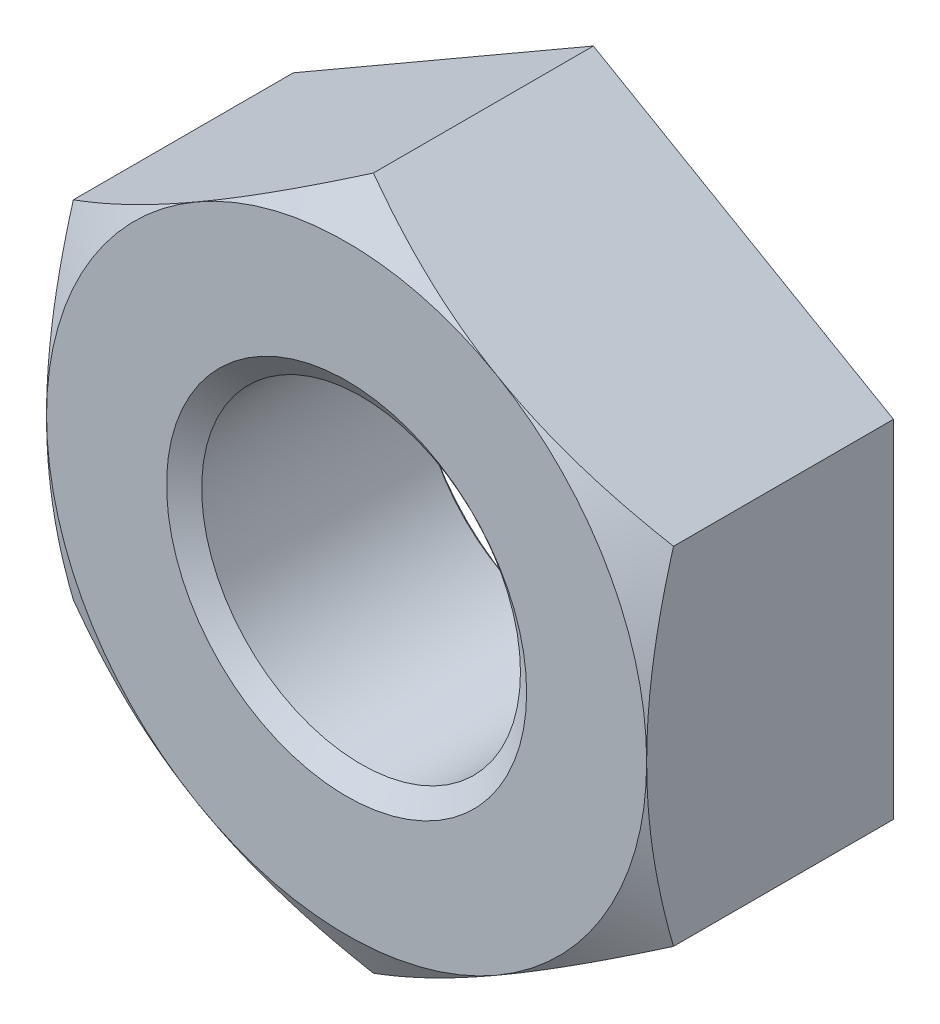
ISO-10303-21;
HEADER;
FILE_DESCRIPTION(('STEP AP214'),'2;1');
FILE_NAME('part.step','',(''),(''),'','','');
FILE_SCHEMA(('AUTOMOTIVE_DESIGN { 1 0 10303 214 1 1 1 1 }'));
ENDSEC;
DATA;
#1=APPLICATION_CONTEXT('core data for automotive mechanical design processes');
#2=APPLICATION_PROTOCOL_DEFINITION('international standard','automotive_design',2000,#1);
#3=PRODUCT_CONTEXT('',#1,'mechanical');
#4=PRODUCT('Part','Part','',(#3));
#5=PRODUCT_RELATED_PRODUCT_CATEGORY('part','',(#4));
#6=PRODUCT_DEFINITION_FORMATION('','',#4);
#7=PRODUCT_DEFINITION_CONTEXT('part definition',#1,'design');
#8=PRODUCT_DEFINITION('design','',#6,#7);
#9=PRODUCT_DEFINITION_SHAPE('','',#8);
#10=(LENGTH_UNIT() NAMED_UNIT(*) SI_UNIT(.MILLI.,.METRE.));
#11=(NAMED_UNIT(*) PLANE_ANGLE_UNIT() SI_UNIT($,.RADIAN.));
#12=(NAMED_UNIT(*) SI_UNIT($,.STERADIAN.) SOLID_ANGLE_UNIT());
#13=UNCERTAINTY_MEASURE_WITH_UNIT(LENGTH_MEASURE(1.E-05),#10,'distance_accuracy_value','');
#14=(GEOMETRIC_REPRESENTATION_CONTEXT(3) GLOBAL_UNCERTAINTY_ASSIGNED_CONTEXT((#13)) GLOBAL_UNIT_ASSIGNED_CONTEXT((#10,
#11,#12)) REPRESENTATION_CONTEXT('',''));
#15=CARTESIAN_POINT('',(0.,0.,0.));
#16=DIRECTION('',(0.,0.,1.));
#17=DIRECTION('',(1.,0.,0.));
#18=AXIS2_PLACEMENT_3D('',#15,#16,#17);
#19=CARTESIAN_POINT('',(0.,0.,-6.5278));
#20=DIRECTION('',(0.,0.,1.));
#21=DIRECTION('',(1.,0.,0.));
#22=AXIS2_PLACEMENT_3D('',#19,#20,#21);
#23=CYLINDRICAL_SURFACE('',#22,4.2164);
#24=CARTESIAN_POINT('',(0.,0.,-0.38238333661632));
#25=DIRECTION('',(0.,0.,1.));
#26=DIRECTION('',(1.,0.,0.));
#27=AXIS2_PLACEMENT_3D('',#24,#25,#26);
#28=CIRCLE('',#27,4.2164);
#29=CARTESIAN_POINT('',(4.2164,0.,-0.38238333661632));
#30=VERTEX_POINT('',#29);
#31=EDGE_CURVE('E129',#30,#30,#28,.F.);
#32=ORIENTED_EDGE('',*,*,#31,.F.);
#33=EDGE_LOOP('',(#32));
#34=FACE_BOUND('',#33,.T.);
#35=CARTESIAN_POINT('',(0.,0.,-6.12001666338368));
#36=DIRECTION('',(0.,0.,-1.));
#37=DIRECTION('',(-1.,0.,0.));
#38=AXIS2_PLACEMENT_3D('',#35,#36,#37);
#39=CIRCLE('',#38,4.2164);
#40=CARTESIAN_POINT('',(-4.2164,0.,-6.12001666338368));
#41=VERTEX_POINT('',#40);
#42=EDGE_CURVE('E35',#41,#41,#39,.F.);
#43=ORIENTED_EDGE('',*,*,#42,.F.);
#44=EDGE_LOOP('',(#43));
#45=FACE_BOUND('',#44,.T.);
#46=ADVANCED_FACE('F30',(#34,#45),#23,.F.);
#47=CARTESIAN_POINT('',(7.9375,13.7481532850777,-6.5278));
#48=DIRECTION('',(0.,0.,1.));
#49=DIRECTION('',(1.,0.,0.));
#50=AXIS2_PLACEMENT_3D('',#47,#48,#49);
#51=PLANE('',#50);
#52=DIRECTION('',(-0.866025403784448,-0.499999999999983,0.));
#53=VECTOR('',#52,1.);
#54=CARTESIAN_POINT('',(0.,9.16543552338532,-6.5278));
#55=LINE('',#54,#53);
#56=CARTESIAN_POINT('',(0.,9.16543552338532,-6.5278));
#57=VERTEX_POINT('',#56);
#58=CARTESIAN_POINT('',(-7.9375,4.58271776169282,-6.5278));
#59=VERTEX_POINT('',#58);
#60=EDGE_CURVE('E252',#57,#59,#55,.T.);
#61=ORIENTED_EDGE('',*,*,#60,.F.);
#62=DIRECTION('',(-0.866025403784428,0.500000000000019,0.));
#63=VECTOR('',#62,1.);
#64=CARTESIAN_POINT('',(7.9375,4.58271776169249,-6.5278));
#65=LINE('',#64,#63);
#66=CARTESIAN_POINT('',(7.9375,4.58271776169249,-6.5278));
#67=VERTEX_POINT('',#66);
#68=EDGE_CURVE('E228',#67,#57,#65,.T.);
#69=ORIENTED_EDGE('',*,*,#68,.F.);
#70=DIRECTION('',(0.,-1.,0.));
#71=VECTOR('',#70,1.);
#72=CARTESIAN_POINT('',(7.9375,4.58271776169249,-6.5278));
#73=LINE('',#72,#71);
#74=CARTESIAN_POINT('',(7.9375,-4.58271776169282,-6.5278));
#75=VERTEX_POINT('',#74);
#76=EDGE_CURVE('E241',#67,#75,#73,.T.);
#77=ORIENTED_EDGE('',*,*,#76,.T.);
#78=DIRECTION('',(0.866025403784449,0.499999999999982,0.));
#79=VECTOR('',#78,1.);
#80=CARTESIAN_POINT('',(0.,-9.1654355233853,-6.5278));
#81=LINE('',#80,#79);
#82=CARTESIAN_POINT('',(0.,-9.1654355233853,-6.5278));
#83=VERTEX_POINT('',#82);
#84=EDGE_CURVE('E243',#83,#75,#81,.T.);
#85=ORIENTED_EDGE('',*,*,#84,.F.);
#86=DIRECTION('',(0.866025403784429,-0.500000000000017,0.));
#87=VECTOR('',#86,1.);
#88=CARTESIAN_POINT('',(-7.9375,-4.58271776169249,-6.5278));
#89=LINE('',#88,#87);
#90=CARTESIAN_POINT('',(-7.9375,-4.58271776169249,-6.5278));
#91=VERTEX_POINT('',#90);
#92=EDGE_CURVE('E246',#91,#83,#89,.T.);
#93=ORIENTED_EDGE('',*,*,#92,.F.);
#94=DIRECTION('',(0.,-1.,0.));
#95=VECTOR('',#94,1.);
#96=CARTESIAN_POINT('',(-7.9375,4.58271776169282,-6.5278));
#97=LINE('',#96,#95);
#98=EDGE_CURVE('E249',#59,#91,#97,.T.);
#99=ORIENTED_EDGE('',*,*,#98,.F.);
#100=EDGE_LOOP('',(#61,#69,#77,#85,#93,#99));
#101=FACE_BOUND('',#100,.T.);
#102=CARTESIAN_POINT('',(0.,0.,-6.5278));
#103=DIRECTION('',(0.,0.,1.));
#104=DIRECTION('',(1.,0.,0.));
#105=AXIS2_PLACEMENT_3D('',#102,#103,#104);
#106=CIRCLE('',#105,4.7625);
#107=CARTESIAN_POINT('',(4.7625,0.,-6.5278));
#108=VERTEX_POINT('',#107);
#109=EDGE_CURVE('E213',#108,#108,#106,.F.);
#110=ORIENTED_EDGE('',*,*,#109,.F.);
#111=EDGE_LOOP('',(#110));
#112=FACE_BOUND('',#111,.T.);
#113=ADVANCED_FACE('F200',(#101,#112),#51,.F.);
#114=CARTESIAN_POINT('',(7.9375,13.7481532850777,0.));
#115=DIRECTION('',(0.,0.,1.));
#116=DIRECTION('',(1.,0.,0.));
#117=AXIS2_PLACEMENT_3D('',#114,#115,#116);
#118=PLANE('',#117);
#119=CARTESIAN_POINT('',(0.,0.,0.));
#120=DIRECTION('',(0.,0.,1.));
#121=DIRECTION('',(1.,0.,0.));
#122=AXIS2_PLACEMENT_3D('',#119,#120,#121);
#123=CIRCLE('',#122,7.9375);
#124=CARTESIAN_POINT('',(7.9375,0.,0.));
#125=VERTEX_POINT('',#124);
#126=CARTESIAN_POINT('',(3.96874999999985,-6.87407664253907,0.));
#127=VERTEX_POINT('',#126);
#128=EDGE_CURVE('E11',#125,#127,#123,.F.);
#129=ORIENTED_EDGE('',*,*,#128,.F.);
#130=CARTESIAN_POINT('',(0.,0.,0.));
#131=DIRECTION('',(0.,0.,1.));
#132=DIRECTION('',(1.,0.,0.));
#133=AXIS2_PLACEMENT_3D('',#130,#131,#132);
#134=CIRCLE('',#133,7.9375);
#135=CARTESIAN_POINT('',(3.96875000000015,6.8740766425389,0.));
#136=VERTEX_POINT('',#135);
#137=EDGE_CURVE('E121',#125,#136,#134,.T.);
#138=ORIENTED_EDGE('',*,*,#137,.T.);
#139=CARTESIAN_POINT('',(-3.96874999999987,6.87407664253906,0.));
#140=VERTEX_POINT('',#139);
#141=EDGE_CURVE('E42',#140,#136,#123,.F.);
#142=ORIENTED_EDGE('',*,*,#141,.F.);
#143=CARTESIAN_POINT('',(-7.9375,0.,0.));
#144=VERTEX_POINT('',#143);
#145=EDGE_CURVE('E281',#144,#140,#123,.F.);
#146=ORIENTED_EDGE('',*,*,#145,.F.);
#147=CARTESIAN_POINT('',(-3.96875000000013,-6.8740766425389,0.));
#148=VERTEX_POINT('',#147);
#149=EDGE_CURVE('E279',#148,#144,#123,.F.);
#150=ORIENTED_EDGE('',*,*,#149,.F.);
#151=EDGE_CURVE('E40',#127,#148,#123,.F.);
#152=ORIENTED_EDGE('',*,*,#151,.F.);
#153=EDGE_LOOP('',(#129,#138,#142,#146,#150,#152));
#154=FACE_BOUND('',#153,.T.);
#155=CARTESIAN_POINT('',(0.,0.,0.));
#156=DIRECTION('',(0.,0.,1.));
#157=DIRECTION('',(1.,0.,0.));
#158=AXIS2_PLACEMENT_3D('',#155,#156,#157);
#159=CIRCLE('',#158,4.7625);
#160=CARTESIAN_POINT('',(4.7625,0.,0.));
#161=VERTEX_POINT('',#160);
#162=EDGE_CURVE('E212',#161,#161,#159,.T.);
#163=ORIENTED_EDGE('',*,*,#162,.F.);
#164=EDGE_LOOP('',(#163));
#165=FACE_BOUND('',#164,.T.);
#166=ADVANCED_FACE('F131',(#154,#165),#118,.T.);
#167=CARTESIAN_POINT('',(0.,9.16543552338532,-6.5278));
#168=DIRECTION('',(-0.499999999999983,0.866025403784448,0.));
#169=DIRECTION('',(-0.866025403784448,-0.499999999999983,0.));
#170=AXIS2_PLACEMENT_3D('',#167,#168,#169);
#171=PLANE('',#170);
#172=DIRECTION('',(0.,0.,1.));
#173=VECTOR('',#172,1.);
#174=CARTESIAN_POINT('',(-7.9375,4.58271776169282,-6.5278));
#175=LINE('',#174,#173);
#176=CARTESIAN_POINT('',(-7.9375,4.58271776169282,-0.708948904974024));
#177=VERTEX_POINT('',#176);
#178=EDGE_CURVE('E224',#59,#177,#175,.T.);
#179=ORIENTED_EDGE('',*,*,#178,.T.);
#180=CARTESIAN_POINT('',(-7.9377,4.58260229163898,-0.709015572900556));
#181=CARTESIAN_POINT('',(-7.76322502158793,4.68333546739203,-0.650866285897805));
#182=CARTESIAN_POINT('',(-7.58809953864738,4.78444421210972,-0.595356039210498));
#183=CARTESIAN_POINT('',(-7.23642632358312,4.98748283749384,-0.490340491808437));
#184=CARTESIAN_POINT('',(-7.05987801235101,5.08941305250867,-0.440837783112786));
#185=CARTESIAN_POINT('',(-6.52740632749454,5.39683572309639,-0.302312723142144));
#186=CARTESIAN_POINT('',(-6.16938105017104,5.60354171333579,-0.223521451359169));
#187=CARTESIAN_POINT('',(-5.63360314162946,5.91287323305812,-0.131129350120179));
#188=CARTESIAN_POINT('',(-5.45745113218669,6.01457464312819,-0.104809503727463));
#189=CARTESIAN_POINT('',(-5.10435050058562,6.21843738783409,-0.0606755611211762));
#190=CARTESIAN_POINT('',(-4.92740195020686,6.32059868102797,-0.0428607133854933));
#191=CARTESIAN_POINT('',(-4.57320017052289,6.52509717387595,-0.0161882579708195));
#192=CARTESIAN_POINT('',(-4.39594751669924,6.6274340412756,-0.00732048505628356));
#193=CARTESIAN_POINT('',(-4.04127846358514,6.83220231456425,0.00126770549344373));
#194=CARTESIAN_POINT('',(-3.86386206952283,6.93463371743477,0.000988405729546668));
#195=CARTESIAN_POINT('',(-3.53217533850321,7.12613314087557,-0.00808134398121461));
#196=CARTESIAN_POINT('',(-3.37788159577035,7.21521467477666,-0.015765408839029));
#197=CARTESIAN_POINT('',(-3.06965548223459,7.39316910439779,-0.0379026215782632));
#198=CARTESIAN_POINT('',(-2.91572313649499,7.48204198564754,-0.0523562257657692));
#199=CARTESIAN_POINT('',(-2.45452203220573,7.74831656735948,-0.105529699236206));
#200=CARTESIAN_POINT('',(-2.14806963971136,7.92524693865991,-0.154055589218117));
#201=CARTESIAN_POINT('',(-1.5319140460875,8.28098453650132,-0.275371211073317));
#202=CARTESIAN_POINT('',(-1.22228948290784,8.4597463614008,-0.348675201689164));
#203=CARTESIAN_POINT('',(-0.607657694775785,8.81460418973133,-0.51504499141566));
#204=CARTESIAN_POINT('',(-0.30264259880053,8.99070473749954,-0.608071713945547));
#205=CARTESIAN_POINT('',(0.000200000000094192,9.16555099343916,-0.709015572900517));
#206=B_SPLINE_CURVE_WITH_KNOTS('',3,(#180,#181,#182,#183,#184,#185,#186,#187,#188,#189,#190,
#191,#192,#193,#194,#195,#196,#197,#198,#199,#200,#201,#202,#203,#204,#205),.UNSPECIFIED.,.F.,
.F.,(4,2,2,2,2,2,2,2,2,2,2,2,4),(0.,0.629020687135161,1.25831181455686,2.51950872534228,
3.13466137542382,3.74975965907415,4.36415830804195,4.97853797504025,5.5133907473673,
6.04827957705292,7.11881916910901,8.21310135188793,9.30523536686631),.UNSPECIFIED.);
#207=EDGE_CURVE('E115',#177,#140,#206,.T.);
#208=ORIENTED_EDGE('',*,*,#207,.T.);
#209=CARTESIAN_POINT('',(0.,9.16543552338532,-0.708948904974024));
#210=VERTEX_POINT('',#209);
#211=EDGE_CURVE('E142',#140,#210,#206,.T.);
#212=ORIENTED_EDGE('',*,*,#211,.T.);
#213=DIRECTION('',(0.,0.,1.));
#214=VECTOR('',#213,1.);
#215=CARTESIAN_POINT('',(0.,9.16543552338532,-6.5278));
#216=LINE('',#215,#214);
#217=EDGE_CURVE('E236',#57,#210,#216,.T.);
#218=ORIENTED_EDGE('',*,*,#217,.F.);
#219=ORIENTED_EDGE('',*,*,#60,.T.);
#220=EDGE_LOOP('',(#179,#208,#212,#218,#219));
#221=FACE_BOUND('',#220,.T.);
#222=ADVANCED_FACE('F32',(#221),#171,.T.);
#223=CARTESIAN_POINT('',(7.9375,4.58271776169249,-6.5278));
#224=DIRECTION('',(0.500000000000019,0.866025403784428,0.));
#225=DIRECTION('',(-0.866025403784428,0.500000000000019,0.));
#226=AXIS2_PLACEMENT_3D('',#223,#224,#225);
#227=PLANE('',#226);
#228=ORIENTED_EDGE('',*,*,#217,.T.);
#229=CARTESIAN_POINT('',(-0.000199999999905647,9.16555099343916,-0.709015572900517));
#230=CARTESIAN_POINT('',(0.174274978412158,9.06481781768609,-0.650866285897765));
#231=CARTESIAN_POINT('',(0.349400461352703,8.9637090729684,-0.595356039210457));
#232=CARTESIAN_POINT('',(0.701073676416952,8.76067044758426,-0.490340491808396));
#233=CARTESIAN_POINT('',(0.87762198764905,8.65874023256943,-0.440837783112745));
#234=CARTESIAN_POINT('',(1.41009367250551,8.35131756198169,-0.302312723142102));
#235=CARTESIAN_POINT('',(1.76811894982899,8.14461157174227,-0.223521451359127));
#236=CARTESIAN_POINT('',(2.30389685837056,7.83528005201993,-0.131129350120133));
#237=CARTESIAN_POINT('',(2.48004886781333,7.73357864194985,-0.104809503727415));
#238=CARTESIAN_POINT('',(2.83314949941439,7.52971589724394,-0.0606755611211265));
#239=CARTESIAN_POINT('',(3.01009804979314,7.42755460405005,-0.0428607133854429));
#240=CARTESIAN_POINT('',(3.3642998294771,7.22305611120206,-0.0161882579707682));
#241=CARTESIAN_POINT('',(3.54155248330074,7.1207192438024,-0.00732048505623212));
#242=CARTESIAN_POINT('',(3.89622153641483,6.91595097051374,0.00126770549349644));
#243=CARTESIAN_POINT('',(4.07363793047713,6.81351956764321,0.000988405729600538));
#244=CARTESIAN_POINT('',(4.40532466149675,6.6220201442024,-0.00808134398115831));
#245=CARTESIAN_POINT('',(4.55961840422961,6.53293861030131,-0.0157654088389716));
#246=CARTESIAN_POINT('',(4.86784451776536,6.35498418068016,-0.0379026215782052));
#247=CARTESIAN_POINT('',(5.02177686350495,6.26611129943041,-0.0523562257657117));
#248=CARTESIAN_POINT('',(5.48297796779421,5.99983671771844,-0.105529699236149));
#249=CARTESIAN_POINT('',(5.78943036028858,5.822906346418,-0.154055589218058));
#250=CARTESIAN_POINT('',(6.40558595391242,5.46716874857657,-0.275371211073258));
#251=CARTESIAN_POINT('',(6.71521051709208,5.28840692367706,-0.348675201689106));
#252=CARTESIAN_POINT('',(7.32984230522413,4.9335490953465,-0.515044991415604));
#253=CARTESIAN_POINT('',(7.63485740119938,4.75744854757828,-0.608071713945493));
#254=CARTESIAN_POINT('',(7.9377,4.58260229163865,-0.709015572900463));
#255=B_SPLINE_CURVE_WITH_KNOTS('',3,(#229,#230,#231,#232,#233,#234,#235,#236,#237,#238,#239,
#240,#241,#242,#243,#244,#245,#246,#247,#248,#249,#250,#251,#252,#253,#254),.UNSPECIFIED.,.F.,
.F.,(4,2,2,2,2,2,2,2,2,2,2,2,4),(0.,0.629020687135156,1.25831181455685,2.51950872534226,
3.1346613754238,3.74975965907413,4.36415830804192,4.97853797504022,5.51339074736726,
6.0482795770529,7.11881916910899,8.21310135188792,9.30523536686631),.UNSPECIFIED.);
#256=EDGE_CURVE('E138',#210,#136,#255,.T.);
#257=ORIENTED_EDGE('',*,*,#256,.T.);
#258=CARTESIAN_POINT('',(7.9375,4.58271776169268,-0.708948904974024));
#259=VERTEX_POINT('',#258);
#260=EDGE_CURVE('E124',#136,#259,#255,.T.);
#261=ORIENTED_EDGE('',*,*,#260,.T.);
#262=DIRECTION('',(0.,0.,1.));
#263=VECTOR('',#262,1.);
#264=CARTESIAN_POINT('',(7.9375,4.58271776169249,-6.5278));
#265=LINE('',#264,#263);
#266=EDGE_CURVE('E137',#67,#259,#265,.T.);
#267=ORIENTED_EDGE('',*,*,#266,.F.);
#268=ORIENTED_EDGE('',*,*,#68,.T.);
#269=EDGE_LOOP('',(#228,#257,#261,#267,#268));
#270=FACE_BOUND('',#269,.T.);
#271=ADVANCED_FACE('F257',(#270),#227,.T.);
#272=CARTESIAN_POINT('',(7.9375,4.58271776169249,-6.5278));
#273=DIRECTION('',(-1.,0.,0.));
#274=DIRECTION('',(0.,0.,1.));
#275=AXIS2_PLACEMENT_3D('',#272,#273,#274);
#276=PLANE('',#275);
#277=CARTESIAN_POINT('',(7.9375,-12.1540428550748,-3.79830572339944));
#278=CARTESIAN_POINT('',(7.9375,-11.8055417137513,-3.62989072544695));
#279=CARTESIAN_POINT('',(7.9375,-11.4562166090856,-3.46314991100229));
#280=CARTESIAN_POINT('',(7.9375,-10.7554729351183,-3.13397333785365));
#281=CARTESIAN_POINT('',(7.9375,-10.4040540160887,-2.97153832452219));
#282=CARTESIAN_POINT('',(7.9375,-9.69677883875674,-2.65107432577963));
#283=CARTESIAN_POINT('',(7.9375,-9.34090869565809,-2.49307587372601));
#284=CARTESIAN_POINT('',(7.9375,-8.62624353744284,-2.18386537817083));
#285=CARTESIAN_POINT('',(7.9375,-8.26744867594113,-2.03265298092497));
#286=CARTESIAN_POINT('',(7.9375,-7.54190895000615,-1.73702395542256));
#287=CARTESIAN_POINT('',(7.9375,-7.17512056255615,-1.59271354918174));
#288=CARTESIAN_POINT('',(7.9375,-6.4372184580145,-1.31539498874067));
#289=CARTESIAN_POINT('',(7.9375,-6.066104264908,-1.18238809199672));
#290=CARTESIAN_POINT('',(7.9375,-5.31971777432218,-0.931250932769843));
#291=CARTESIAN_POINT('',(7.9375,-4.94445623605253,-0.813089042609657));
#292=CARTESIAN_POINT('',(7.9375,-4.18861180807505,-0.595477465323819));
#293=CARTESIAN_POINT('',(7.9375,-3.80803064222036,-0.496021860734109));
#294=CARTESIAN_POINT('',(7.9375,-3.0412234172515,-0.320658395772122));
#295=CARTESIAN_POINT('',(7.9375,-2.65499588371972,-0.244756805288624));
#296=CARTESIAN_POINT('',(7.9375,-2.07225592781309,-0.152370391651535));
#297=CARTESIAN_POINT('',(7.9375,-1.87741892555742,-0.125150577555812));
#298=CARTESIAN_POINT('',(7.9375,-1.48683143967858,-0.078401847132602));
#299=CARTESIAN_POINT('',(7.9375,-1.29108104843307,-0.0588721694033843));
#300=CARTESIAN_POINT('',(7.9375,-0.900173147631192,-0.0280292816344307));
#301=CARTESIAN_POINT('',(7.9375,-0.705019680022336,-0.0166650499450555));
#302=CARTESIAN_POINT('',(7.9375,-0.314406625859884,-0.0022131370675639));
#303=CARTESIAN_POINT('',(7.9375,-0.118947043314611,0.000874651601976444));
#304=CARTESIAN_POINT('',(7.9375,0.271871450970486,-0.00129989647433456));
#305=CARTESIAN_POINT('',(7.9375,0.467230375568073,-0.00655988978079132));
#306=CARTESIAN_POINT('',(7.9375,0.857556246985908,-0.0252991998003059));
#307=CARTESIAN_POINT('',(7.9375,1.05252317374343,-0.0387789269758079));
#308=CARTESIAN_POINT('',(7.9375,1.52506297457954,-0.0811297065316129));
#309=CARTESIAN_POINT('',(7.9375,1.80227278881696,-0.114119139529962));
#310=CARTESIAN_POINT('',(7.9375,2.35456818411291,-0.194883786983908));
#311=CARTESIAN_POINT('',(7.9375,2.62965316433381,-0.242663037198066));
#312=CARTESIAN_POINT('',(7.9375,3.17747194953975,-0.351312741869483));
#313=CARTESIAN_POINT('',(7.9375,3.4502032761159,-0.412195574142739));
#314=CARTESIAN_POINT('',(7.9375,3.99285991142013,-0.545194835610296));
#315=CARTESIAN_POINT('',(7.9375,4.26278548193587,-0.617310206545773));
#316=CARTESIAN_POINT('',(7.9375,4.80647881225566,-0.772934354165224));
#317=CARTESIAN_POINT('',(7.9375,5.08017856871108,-0.856679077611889));
#318=CARTESIAN_POINT('',(7.9375,5.62468506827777,-1.03244298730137));
#319=CARTESIAN_POINT('',(7.9375,5.89549366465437,-1.12445646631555));
#320=CARTESIAN_POINT('',(7.9375,6.43313118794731,-1.31485725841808));
#321=CARTESIAN_POINT('',(7.9375,6.69997393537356,-1.4132057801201));
#322=CARTESIAN_POINT('',(7.9375,7.23158910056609,-1.61567532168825));
#323=CARTESIAN_POINT('',(7.9375,7.49636063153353,-1.71979867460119));
#324=CARTESIAN_POINT('',(7.9375,7.76017027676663,-1.82623818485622));
#325=B_SPLINE_CURVE_WITH_KNOTS('',3,(#277,#278,#279,#280,#281,#282,#283,#284,#285,#286,#287,
#288,#289,#290,#291,#292,#293,#294,#295,#296,#297,#298,#299,#300,#301,#302,#303,#304,#305,#306,
#307,#308,#309,#310,#311,#312,#313,#314,#315,#316,#317,#318,#319,#320,#321,#322,#323,#324),
.UNSPECIFIED.,.F.,.F.,(4,2,2,2,2,2,2,2,2,2,2,2,2,2,2,2,2,2,2,2,2,2,2,4),(0.,1.16120027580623,
2.3226002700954,3.4906464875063,4.65863174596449,5.84095623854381,7.02341208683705,
8.20330434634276,9.38282273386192,10.5626548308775,11.1527144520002,11.7427156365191,
12.3289973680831,12.9152714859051,13.501381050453,14.0875198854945,14.9245510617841,
15.7618108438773,16.5998650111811,17.4378402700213,18.2963561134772,19.1542838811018,
20.007382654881,20.8608286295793),.UNSPECIFIED.);
#326=CARTESIAN_POINT('',(7.93749999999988,-4.58271776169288,-0.708948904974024));
#327=VERTEX_POINT('',#326);
#328=EDGE_CURVE('E104',#327,#125,#325,.T.);
#329=ORIENTED_EDGE('',*,*,#328,.F.);
#330=DIRECTION('',(0.,0.,1.));
#331=VECTOR('',#330,1.);
#332=CARTESIAN_POINT('',(7.9375,-4.58271776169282,-6.5278));
#333=LINE('',#332,#331);
#334=EDGE_CURVE('E233',#75,#327,#333,.T.);
#335=ORIENTED_EDGE('',*,*,#334,.F.);
#336=ORIENTED_EDGE('',*,*,#76,.F.);
#337=ORIENTED_EDGE('',*,*,#266,.T.);
#338=EDGE_CURVE('E117',#125,#259,#325,.T.);
#339=ORIENTED_EDGE('',*,*,#338,.F.);
#340=EDGE_LOOP('',(#329,#335,#336,#337,#339));
#341=FACE_BOUND('',#340,.T.);
#342=ADVANCED_FACE('F135',(#341),#276,.F.);
#343=CARTESIAN_POINT('',(0.,-9.1654355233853,-6.5278));
#344=DIRECTION('',(0.499999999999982,-0.866025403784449,0.));
#345=DIRECTION('',(0.866025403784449,0.499999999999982,0.));
#346=AXIS2_PLACEMENT_3D('',#343,#344,#345);
#347=PLANE('',#346);
#348=ORIENTED_EDGE('',*,*,#334,.T.);
#349=CARTESIAN_POINT('',(7.9377,-4.58260229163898,-0.709015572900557));
#350=CARTESIAN_POINT('',(7.76322502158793,-4.68333546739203,-0.650866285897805));
#351=CARTESIAN_POINT('',(7.58809953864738,-4.78444421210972,-0.595356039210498));
#352=CARTESIAN_POINT('',(7.23642632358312,-4.98748283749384,-0.490340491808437));
#353=CARTESIAN_POINT('',(7.05987801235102,-5.08941305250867,-0.440837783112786));
#354=CARTESIAN_POINT('',(6.52740632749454,-5.39683572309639,-0.302312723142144));
#355=CARTESIAN_POINT('',(6.16938105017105,-5.60354171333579,-0.223521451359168));
#356=CARTESIAN_POINT('',(5.63360314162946,-5.91287323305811,-0.131129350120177));
#357=CARTESIAN_POINT('',(5.45745113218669,-6.01457464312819,-0.10480950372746));
#358=CARTESIAN_POINT('',(5.10435050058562,-6.21843738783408,-0.0606755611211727));
#359=CARTESIAN_POINT('',(4.92740195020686,-6.32059868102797,-0.0428607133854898));
#360=CARTESIAN_POINT('',(4.57320017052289,-6.52509717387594,-0.016188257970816));
#361=CARTESIAN_POINT('',(4.39594751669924,-6.6274340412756,-0.0073204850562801));
#362=CARTESIAN_POINT('',(4.04127846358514,-6.83220231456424,0.00126770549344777));
#363=CARTESIAN_POINT('',(3.86386206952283,-6.93463371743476,0.000988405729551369));
#364=CARTESIAN_POINT('',(3.5321753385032,-7.12613314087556,-0.00808134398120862));
#365=CARTESIAN_POINT('',(3.37788159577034,-7.21521467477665,-0.0157654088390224));
#366=CARTESIAN_POINT('',(3.06965548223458,-7.39316910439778,-0.0379026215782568));
#367=CARTESIAN_POINT('',(2.91572313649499,-7.48204198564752,-0.0523562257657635));
#368=CARTESIAN_POINT('',(2.45452203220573,-7.74831656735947,-0.105529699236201));
#369=CARTESIAN_POINT('',(2.14806963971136,-7.92524693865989,-0.15405558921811));
#370=CARTESIAN_POINT('',(1.5319140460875,-8.2809845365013,-0.275371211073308));
#371=CARTESIAN_POINT('',(1.22228948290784,-8.45974636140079,-0.348675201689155));
#372=CARTESIAN_POINT('',(0.607657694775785,-8.81460418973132,-0.51504499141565));
#373=CARTESIAN_POINT('',(0.302642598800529,-8.99070473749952,-0.608071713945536));
#374=CARTESIAN_POINT('',(-0.000200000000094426,-9.16555099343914,-0.709015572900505));
#375=B_SPLINE_CURVE_WITH_KNOTS('',3,(#349,#350,#351,#352,#353,#354,#355,#356,#357,#358,#359,
#360,#361,#362,#363,#364,#365,#366,#367,#368,#369,#370,#371,#372,#373,#374),.UNSPECIFIED.,.F.,
.F.,(4,2,2,2,2,2,2,2,2,2,2,2,4),(0.,0.62902068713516,1.25831181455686,2.51950872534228,
3.13466137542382,3.74975965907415,4.36415830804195,4.97853797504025,5.5133907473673,
6.04827957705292,7.11881916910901,8.21310135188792,9.3052353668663),.UNSPECIFIED.);
#376=EDGE_CURVE('E110',#327,#127,#375,.T.);
#377=ORIENTED_EDGE('',*,*,#376,.T.);
#378=CARTESIAN_POINT('',(0.,-9.16543552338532,-0.708948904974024));
#379=VERTEX_POINT('',#378);
#380=EDGE_CURVE('E49',#127,#379,#375,.T.);
#381=ORIENTED_EDGE('',*,*,#380,.T.);
#382=DIRECTION('',(0.,0.,1.));
#383=VECTOR('',#382,1.);
#384=CARTESIAN_POINT('',(0.,-9.1654355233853,-6.5278));
#385=LINE('',#384,#383);
#386=EDGE_CURVE('E230',#83,#379,#385,.T.);
#387=ORIENTED_EDGE('',*,*,#386,.F.);
#388=ORIENTED_EDGE('',*,*,#84,.T.);
#389=EDGE_LOOP('',(#348,#377,#381,#387,#388));
#390=FACE_BOUND('',#389,.T.);
#391=ADVANCED_FACE('F189',(#390),#347,.T.);
#392=CARTESIAN_POINT('',(-7.9375,-4.58271776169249,-6.5278));
#393=DIRECTION('',(-0.500000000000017,-0.866025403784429,0.));
#394=DIRECTION('',(0.866025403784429,-0.500000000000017,0.));
#395=AXIS2_PLACEMENT_3D('',#392,#393,#394);
#396=PLANE('',#395);
#397=ORIENTED_EDGE('',*,*,#386,.T.);
#398=CARTESIAN_POINT('',(0.000199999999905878,-9.16555099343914,-0.709015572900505));
#399=CARTESIAN_POINT('',(-0.174274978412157,-9.06481781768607,-0.650866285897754));
#400=CARTESIAN_POINT('',(-0.349400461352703,-8.96370907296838,-0.595356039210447));
#401=CARTESIAN_POINT('',(-0.701073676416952,-8.76067044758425,-0.490340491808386));
#402=CARTESIAN_POINT('',(-0.87762198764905,-8.65874023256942,-0.440837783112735));
#403=CARTESIAN_POINT('',(-1.41009367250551,-8.35131756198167,-0.302312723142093));
#404=CARTESIAN_POINT('',(-1.76811894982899,-8.14461157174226,-0.223521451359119));
#405=CARTESIAN_POINT('',(-2.30389685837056,-7.83528005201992,-0.131129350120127));
#406=CARTESIAN_POINT('',(-2.48004886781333,-7.73357864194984,-0.104809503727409));
#407=CARTESIAN_POINT('',(-2.83314949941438,-7.52971589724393,-0.0606755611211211));
#408=CARTESIAN_POINT('',(-3.01009804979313,-7.42755460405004,-0.0428607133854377));
#409=CARTESIAN_POINT('',(-3.36429982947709,-7.22305611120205,-0.0161882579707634));
#410=CARTESIAN_POINT('',(-3.54155248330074,-7.12071924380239,-0.00732048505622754));
#411=CARTESIAN_POINT('',(-3.89622153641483,-6.91595097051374,0.00126770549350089));
#412=CARTESIAN_POINT('',(-4.07363793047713,-6.81351956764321,0.000988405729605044));
#413=CARTESIAN_POINT('',(-4.40532466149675,-6.6220201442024,-0.0080813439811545));
#414=CARTESIAN_POINT('',(-4.5596184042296,-6.5329386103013,-0.0157654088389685));
#415=CARTESIAN_POINT('',(-4.86784451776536,-6.35498418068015,-0.0379026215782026));
#416=CARTESIAN_POINT('',(-5.02177686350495,-6.26611129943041,-0.0523562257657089));
#417=CARTESIAN_POINT('',(-5.48297796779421,-5.99983671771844,-0.105529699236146));
#418=CARTESIAN_POINT('',(-5.78943036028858,-5.822906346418,-0.154055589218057));
#419=CARTESIAN_POINT('',(-6.40558595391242,-5.46716874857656,-0.275371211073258));
#420=CARTESIAN_POINT('',(-6.71521051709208,-5.28840692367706,-0.348675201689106));
#421=CARTESIAN_POINT('',(-7.32984230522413,-4.9335490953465,-0.515044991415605));
#422=CARTESIAN_POINT('',(-7.63485740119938,-4.75744854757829,-0.608071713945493));
#423=CARTESIAN_POINT('',(-7.9377,-4.58260229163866,-0.709015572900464));
#424=B_SPLINE_CURVE_WITH_KNOTS('',3,(#398,#399,#400,#401,#402,#403,#404,#405,#406,#407,#408,
#409,#410,#411,#412,#413,#414,#415,#416,#417,#418,#419,#420,#421,#422,#423),.UNSPECIFIED.,.F.,
.F.,(4,2,2,2,2,2,2,2,2,2,2,2,4),(0.,0.629020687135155,1.25831181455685,2.51950872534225,
3.13466137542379,3.74975965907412,4.3641583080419,4.9785379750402,5.51339074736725,
6.04827957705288,7.11881916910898,8.21310135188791,9.3052353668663),.UNSPECIFIED.);
#425=EDGE_CURVE('E183',#379,#148,#424,.T.);
#426=ORIENTED_EDGE('',*,*,#425,.T.);
#427=CARTESIAN_POINT('',(-7.9375,-4.58271776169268,-0.708948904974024));
#428=VERTEX_POINT('',#427);
#429=EDGE_CURVE('E56',#148,#428,#424,.T.);
#430=ORIENTED_EDGE('',*,*,#429,.T.);
#431=DIRECTION('',(0.,0.,1.));
#432=VECTOR('',#431,1.);
#433=CARTESIAN_POINT('',(-7.9375,-4.58271776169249,-6.5278));
#434=LINE('',#433,#432);
#435=EDGE_CURVE('E227',#91,#428,#434,.T.);
#436=ORIENTED_EDGE('',*,*,#435,.F.);
#437=ORIENTED_EDGE('',*,*,#92,.T.);
#438=EDGE_LOOP('',(#397,#426,#430,#436,#437));
#439=FACE_BOUND('',#438,.T.);
#440=ADVANCED_FACE('F185',(#439),#396,.T.);
#441=CARTESIAN_POINT('',(-7.9375,4.58271776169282,-6.5278));
#442=DIRECTION('',(-1.,0.,0.));
#443=DIRECTION('',(0.,-1.,0.));
#444=AXIS2_PLACEMENT_3D('',#441,#442,#443);
#445=PLANE('',#444);
#446=ORIENTED_EDGE('',*,*,#435,.T.);
#447=CARTESIAN_POINT('',(-7.93750000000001,-12.1540428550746,-3.79830572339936));
#448=CARTESIAN_POINT('',(-7.9375,-11.8055417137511,-3.62989072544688));
#449=CARTESIAN_POINT('',(-7.9375,-11.4562166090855,-3.46314991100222));
#450=CARTESIAN_POINT('',(-7.9375,-10.7554729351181,-3.13397333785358));
#451=CARTESIAN_POINT('',(-7.9375,-10.4040540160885,-2.97153832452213));
#452=CARTESIAN_POINT('',(-7.9375,-9.69677883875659,-2.65107432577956));
#453=CARTESIAN_POINT('',(-7.9375,-9.34090869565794,-2.49307587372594));
#454=CARTESIAN_POINT('',(-7.9375,-8.62624353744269,-2.18386537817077));
#455=CARTESIAN_POINT('',(-7.9375,-8.26744867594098,-2.03265298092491));
#456=CARTESIAN_POINT('',(-7.9375,-7.54190895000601,-1.7370239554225));
#457=CARTESIAN_POINT('',(-7.9375,-7.17512056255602,-1.59271354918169));
#458=CARTESIAN_POINT('',(-7.9375,-6.43721845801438,-1.31539498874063));
#459=CARTESIAN_POINT('',(-7.9375,-6.06610426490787,-1.18238809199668));
#460=CARTESIAN_POINT('',(-7.9375,-5.31971777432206,-0.931250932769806));
#461=CARTESIAN_POINT('',(-7.9375,-4.94445623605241,-0.813089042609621));
#462=CARTESIAN_POINT('',(-7.9375,-4.18861180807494,-0.595477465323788));
#463=CARTESIAN_POINT('',(-7.9375,-3.80803064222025,-0.496021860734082));
#464=CARTESIAN_POINT('',(-7.9375,-3.04122341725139,-0.320658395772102));
#465=CARTESIAN_POINT('',(-7.9375,-2.65499588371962,-0.244756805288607));
#466=CARTESIAN_POINT('',(-7.9375,-2.072255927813,-0.152370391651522));
#467=CARTESIAN_POINT('',(-7.9375,-1.87741892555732,-0.1251505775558));
#468=CARTESIAN_POINT('',(-7.9375,-1.48683143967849,-0.0784018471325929));
#469=CARTESIAN_POINT('',(-7.9375,-1.29108104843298,-0.0588721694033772));
#470=CARTESIAN_POINT('',(-7.9375,-0.900173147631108,-0.0280292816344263));
#471=CARTESIAN_POINT('',(-7.9375,-0.705019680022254,-0.0166650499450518));
#472=CARTESIAN_POINT('',(-7.9375,-0.314406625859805,-0.00221313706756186));
#473=CARTESIAN_POINT('',(-7.9375,-0.118947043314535,0.00087465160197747));
#474=CARTESIAN_POINT('',(-7.9375,0.27187145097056,-0.00129989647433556));
#475=CARTESIAN_POINT('',(-7.9375,0.467230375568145,-0.00655988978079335));
#476=CARTESIAN_POINT('',(-7.9375,0.857556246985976,-0.0252991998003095));
#477=CARTESIAN_POINT('',(-7.9375,1.0525231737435,-0.038778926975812));
#478=CARTESIAN_POINT('',(-7.9375,1.5250629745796,-0.081129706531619));
#479=CARTESIAN_POINT('',(-7.9375,1.80227278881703,-0.11411913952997));
#480=CARTESIAN_POINT('',(-7.9375,2.35456818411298,-0.194883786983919));
#481=CARTESIAN_POINT('',(-7.9375,2.62965316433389,-0.242663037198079));
#482=CARTESIAN_POINT('',(-7.9375,3.17747194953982,-0.351312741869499));
#483=CARTESIAN_POINT('',(-7.9375,3.45020327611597,-0.412195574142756));
#484=CARTESIAN_POINT('',(-7.9375,3.99285991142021,-0.545194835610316));
#485=CARTESIAN_POINT('',(-7.9375,4.26278548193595,-0.617310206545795));
#486=CARTESIAN_POINT('',(-7.9375,4.80647881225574,-0.772934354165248));
#487=CARTESIAN_POINT('',(-7.9375,5.08017856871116,-0.856679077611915));
#488=CARTESIAN_POINT('',(-7.9375,5.62468506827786,-1.0324429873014));
#489=CARTESIAN_POINT('',(-7.9375,5.89549366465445,-1.12445646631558));
#490=CARTESIAN_POINT('',(-7.9375,6.43313118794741,-1.31485725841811));
#491=CARTESIAN_POINT('',(-7.9375,6.69997393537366,-1.41320578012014));
#492=CARTESIAN_POINT('',(-7.9375,7.23158910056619,-1.61567532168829));
#493=CARTESIAN_POINT('',(-7.9375,7.49636063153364,-1.71979867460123));
#494=CARTESIAN_POINT('',(-7.9375,7.76017027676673,-1.82623818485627));
#495=B_SPLINE_CURVE_WITH_KNOTS('',3,(#447,#448,#449,#450,#451,#452,#453,#454,#455,#456,#457,
#458,#459,#460,#461,#462,#463,#464,#465,#466,#467,#468,#469,#470,#471,#472,#473,#474,#475,#476,
#477,#478,#479,#480,#481,#482,#483,#484,#485,#486,#487,#488,#489,#490,#491,#492,#493,#494),
.UNSPECIFIED.,.F.,.F.,(4,2,2,2,2,2,2,2,2,2,2,2,2,2,2,2,2,2,2,2,2,2,2,4),(0.,1.16120027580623,
2.32260027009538,3.49064648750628,4.65863174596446,5.84095623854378,7.023412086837,
8.2033043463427,9.38282273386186,10.5626548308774,11.1527144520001,11.742715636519,
12.328997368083,12.915271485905,13.5013810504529,14.0875198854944,14.924551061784,
15.7618108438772,16.599865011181,17.4378402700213,18.2963561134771,19.1542838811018,
20.0073826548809,20.8608286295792),.UNSPECIFIED.);
#496=EDGE_CURVE('E184',#428,#144,#495,.T.);
#497=ORIENTED_EDGE('',*,*,#496,.T.);
#498=EDGE_CURVE('E128',#144,#177,#495,.T.);
#499=ORIENTED_EDGE('',*,*,#498,.T.);
#500=ORIENTED_EDGE('',*,*,#178,.F.);
#501=ORIENTED_EDGE('',*,*,#98,.T.);
#502=EDGE_LOOP('',(#446,#497,#499,#500,#501));
#503=FACE_BOUND('',#502,.T.);
#504=ADVANCED_FACE('F188',(#503),#445,.T.);
#505=CARTESIAN_POINT('',(0.,0.,0.));
#506=DIRECTION('',(0.,0.,-1.));
#507=DIRECTION('',(-1.,0.,0.));
#508=AXIS2_PLACEMENT_3D('',#505,#506,#507);
#509=CONICAL_SURFACE('',#508,7.9375,1.04719755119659);
#510=ORIENTED_EDGE('',*,*,#137,.F.);
#511=ORIENTED_EDGE('',*,*,#338,.T.);
#512=ORIENTED_EDGE('',*,*,#260,.F.);
#513=EDGE_LOOP('',(#510,#511,#512));
#514=FACE_BOUND('',#513,.T.);
#515=ADVANCED_FACE('F122',(#514),#509,.T.);
#516=ORIENTED_EDGE('',*,*,#141,.T.);
#517=ORIENTED_EDGE('',*,*,#256,.F.);
#518=ORIENTED_EDGE('',*,*,#211,.F.);
#519=EDGE_LOOP('',(#516,#517,#518));
#520=FACE_BOUND('',#519,.T.);
#521=ADVANCED_FACE('F166',(#520),#509,.T.);
#522=ORIENTED_EDGE('',*,*,#498,.F.);
#523=ORIENTED_EDGE('',*,*,#145,.T.);
#524=ORIENTED_EDGE('',*,*,#207,.F.);
#525=EDGE_LOOP('',(#522,#523,#524));
#526=FACE_BOUND('',#525,.T.);
#527=ADVANCED_FACE('F165',(#526),#509,.T.);
#528=ORIENTED_EDGE('',*,*,#149,.T.);
#529=ORIENTED_EDGE('',*,*,#496,.F.);
#530=ORIENTED_EDGE('',*,*,#429,.F.);
#531=EDGE_LOOP('',(#528,#529,#530));
#532=FACE_BOUND('',#531,.T.);
#533=ADVANCED_FACE('F159',(#532),#509,.T.);
#534=ORIENTED_EDGE('',*,*,#151,.T.);
#535=ORIENTED_EDGE('',*,*,#425,.F.);
#536=ORIENTED_EDGE('',*,*,#380,.F.);
#537=EDGE_LOOP('',(#534,#535,#536));
#538=FACE_BOUND('',#537,.T.);
#539=ADVANCED_FACE('F164',(#538),#509,.T.);
#540=ORIENTED_EDGE('',*,*,#328,.T.);
#541=ORIENTED_EDGE('',*,*,#128,.T.);
#542=ORIENTED_EDGE('',*,*,#376,.F.);
#543=EDGE_LOOP('',(#540,#541,#542));
#544=FACE_BOUND('',#543,.T.);
#545=ADVANCED_FACE('F106',(#544),#509,.T.);
#546=CARTESIAN_POINT('',(0.,0.,-0.420621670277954));
#547=DIRECTION('',(0.,0.,1.));
#548=DIRECTION('',(1.,0.,0.));
#549=AXIS2_PLACEMENT_3D('',#546,#547,#548);
#550=CONICAL_SURFACE('',#549,4.16179,0.959931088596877);
#551=ORIENTED_EDGE('',*,*,#162,.T.);
#552=EDGE_LOOP('',(#551));
#553=FACE_BOUND('',#552,.T.);
#554=ORIENTED_EDGE('',*,*,#31,.T.);
#555=EDGE_LOOP('',(#554));
#556=FACE_BOUND('',#555,.T.);
#557=ADVANCED_FACE('F167',(#553,#556),#550,.F.);
#558=CARTESIAN_POINT('',(0.,0.,-6.5024));
#559=DIRECTION('',(0.,0.,-1.));
#560=DIRECTION('',(-1.,0.,0.));
#561=AXIS2_PLACEMENT_3D('',#558,#559,#560);
#562=CONICAL_SURFACE('',#561,4.7625,0.95993108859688);
#563=CARTESIAN_POINT('',(0.,0.,-6.5024));
#564=DIRECTION('',(0.,0.,1.));
#565=DIRECTION('',(1.,0.,0.));
#566=AXIS2_PLACEMENT_3D('',#563,#564,#565);
#567=CIRCLE('',#566,4.7625);
#568=CARTESIAN_POINT('',(4.7625,0.,-6.5024));
#569=VERTEX_POINT('',#568);
#570=EDGE_CURVE('E217',#569,#569,#567,.T.);
#571=ORIENTED_EDGE('',*,*,#570,.F.);
#572=EDGE_LOOP('',(#571));
#573=FACE_BOUND('',#572,.T.);
#574=ORIENTED_EDGE('',*,*,#42,.T.);
#575=EDGE_LOOP('',(#574));
#576=FACE_BOUND('',#575,.T.);
#577=ADVANCED_FACE('F377',(#573,#576),#562,.F.);
#578=CARTESIAN_POINT('',(0.,0.,-25.0375057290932));
#579=DIRECTION('',(0.,0.,1.));
#580=DIRECTION('',(1.,0.,0.));
#581=AXIS2_PLACEMENT_3D('',#578,#579,#580);
#582=CYLINDRICAL_SURFACE('',#581,4.7625);
#583=ORIENTED_EDGE('',*,*,#570,.T.);
#584=EDGE_LOOP('',(#583));
#585=FACE_BOUND('',#584,.T.);
#586=ORIENTED_EDGE('',*,*,#109,.T.);
#587=EDGE_LOOP('',(#586));
#588=FACE_BOUND('',#587,.T.);
#589=ADVANCED_FACE('F385',(#585,#588),#582,.F.);
#590=CLOSED_SHELL('',(#46,#113,#166,#222,#271,#342,#391,#440,#504,#515,#521,#527,#533,#539,#545,
#557,#577,#589));
#591=MANIFOLD_SOLID_BREP('B2',#590);
#592=ADVANCED_BREP_SHAPE_REPRESENTATION('',(#18,#591),#14);
#593=SHAPE_DEFINITION_REPRESENTATION(#9,#592);
ENDSEC;
END-ISO-10303-21;
